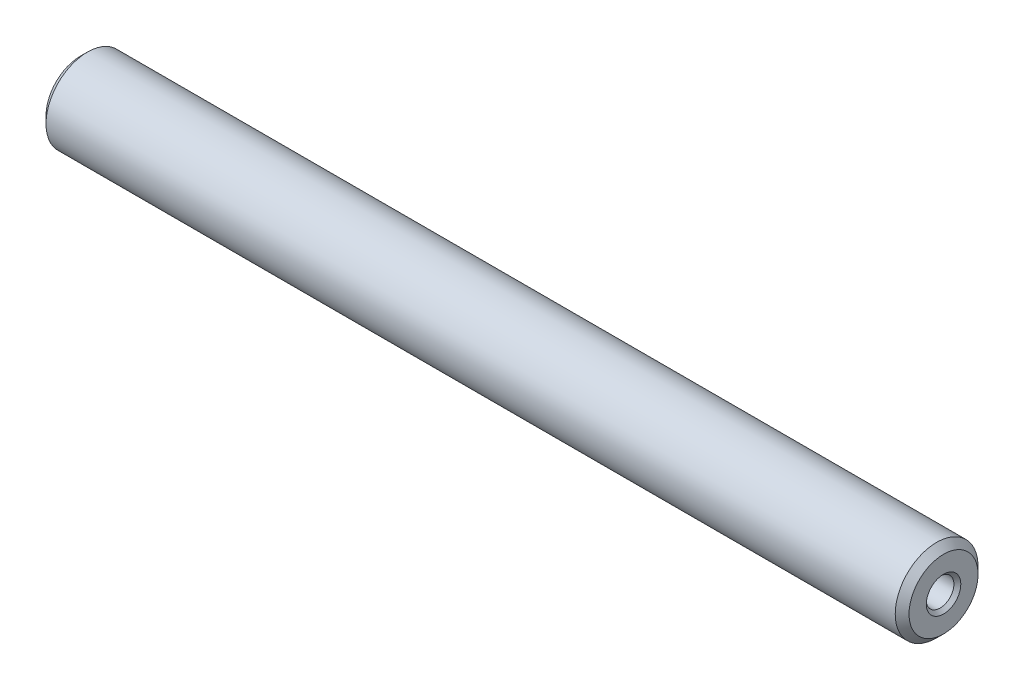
from build123d import *

# Parameters (mm, degrees)
ESQUISSE1_W                                       = 125
ESQUISSE1_H                                       = 6
CHANFREIN1_SIZE                                   = 1
DIAM_TRE_DU_PER_AGE_4_0_4_1_D                     = 4
DIAM_TRE_DU_PER_AGE_4_0_4_1_DEPTH                 = 11
DIAM_TRE_DU_PER_AGE_4_0_4_1_CSINK_D               = 5
DIAM_TRE_DU_PER_AGE_4_0_4_1_CSINK_ANGLE           = 90
DIAM_TRE_DU_PER_AGE_4_0_4_1_TIP                   = 1.201721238
DIAM_TRE_DU_PER_AGE_4_0_4_1_ON_FACE_2_D           = 4
DIAM_TRE_DU_PER_AGE_4_0_4_1_ON_FACE_2_DEPTH       = 11
DIAM_TRE_DU_PER_AGE_4_0_4_1_ON_FACE_2_CSINK_D     = 5
DIAM_TRE_DU_PER_AGE_4_0_4_1_ON_FACE_2_CSINK_ANGLE = 90
DIAM_TRE_DU_PER_AGE_4_0_4_1_ON_FACE_2_TIP         = 1.201721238


with BuildPart() as part:
    # Esquisse1 → R_volution1 (revolve)
    with BuildSketch(Plane.XY, mode=Mode.PRIVATE) as r_volution1_sk:
        with Locations((0, 3)):
            Rectangle(ESQUISSE1_W, ESQUISSE1_H)
    revolve(r_volution1_sk.sketch.rotate(Axis((-35.682971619, 0, 0), (1, 0, 0)), 90), axis=Axis((-35.682971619, 0, 0), (1, 0, 0)))

    # Chanfrein1
    chanfrein1_edges = [part.edges().sort_by_distance(p)[0] for p in [
        (62.5, 0, -6),
        (-62.5, 0, -6),
    ]]
    chamfer(chanfrein1_edges, length=CHANFREIN1_SIZE)

    # Diam_tre du per_age _4.0 _4_1
    with Locations(Plane(origin=(62.5, 0, 0), x_dir=(0, 0, 1), z_dir=(1, 0, 0))):
        with Locations((0, 0)):
            CounterSinkHole(DIAM_TRE_DU_PER_AGE_4_0_4_1_D / 2, DIAM_TRE_DU_PER_AGE_4_0_4_1_CSINK_D / 2, depth=DIAM_TRE_DU_PER_AGE_4_0_4_1_DEPTH, counter_sink_angle=DIAM_TRE_DU_PER_AGE_4_0_4_1_CSINK_ANGLE)
            with Locations((0, 0, -(DIAM_TRE_DU_PER_AGE_4_0_4_1_DEPTH + DIAM_TRE_DU_PER_AGE_4_0_4_1_TIP / 2))):  # 118° drill point
                Cone(0, DIAM_TRE_DU_PER_AGE_4_0_4_1_D / 2, DIAM_TRE_DU_PER_AGE_4_0_4_1_TIP, mode=Mode.SUBTRACT)

    # Diam_tre du per_age _4.0 _4_1 on face 2
    with Locations(Plane(origin=(-62.5, 0, 0), x_dir=(0, 0, -1), z_dir=(-1, 0, 0))):
        with Locations((0, 0)):
            CounterSinkHole(DIAM_TRE_DU_PER_AGE_4_0_4_1_ON_FACE_2_D / 2, DIAM_TRE_DU_PER_AGE_4_0_4_1_ON_FACE_2_CSINK_D / 2, depth=DIAM_TRE_DU_PER_AGE_4_0_4_1_ON_FACE_2_DEPTH, counter_sink_angle=DIAM_TRE_DU_PER_AGE_4_0_4_1_ON_FACE_2_CSINK_ANGLE)
            with Locations((0, 0, -(DIAM_TRE_DU_PER_AGE_4_0_4_1_ON_FACE_2_DEPTH + DIAM_TRE_DU_PER_AGE_4_0_4_1_ON_FACE_2_TIP / 2))):  # 118° drill point
                Cone(0, DIAM_TRE_DU_PER_AGE_4_0_4_1_ON_FACE_2_D / 2, DIAM_TRE_DU_PER_AGE_4_0_4_1_ON_FACE_2_TIP, mode=Mode.SUBTRACT)


solid = part.part
